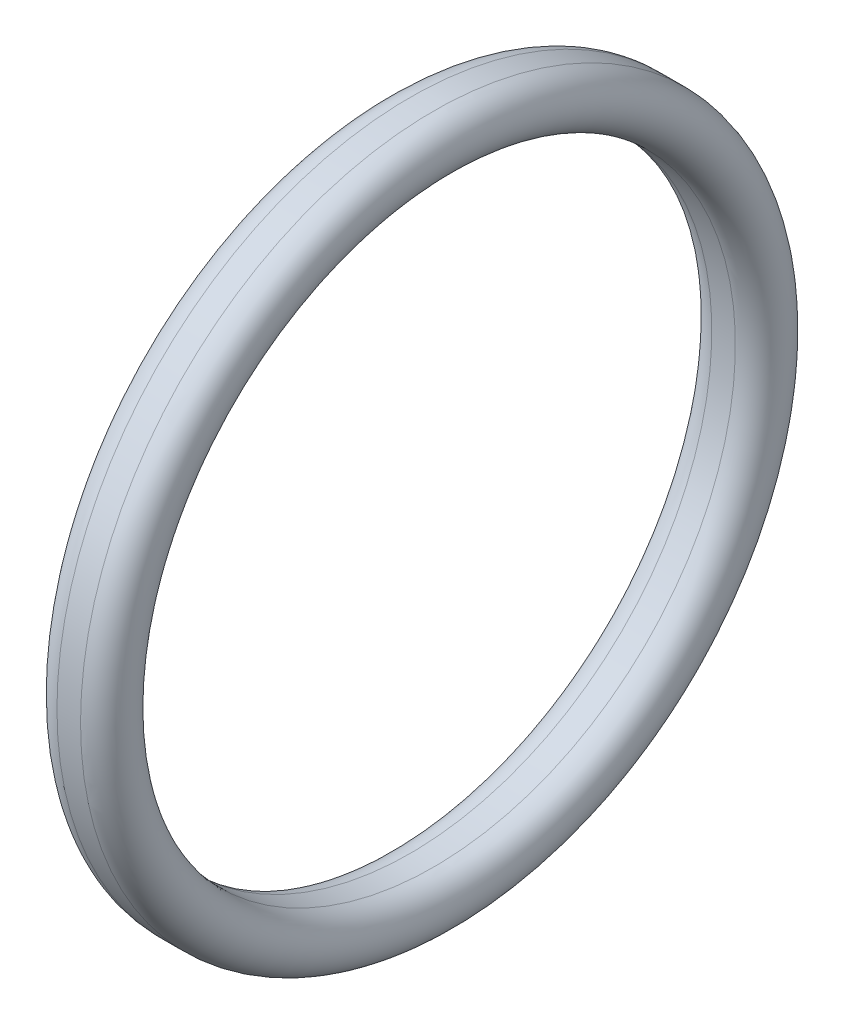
from build123d import *


with BuildPart() as part:
    # Sketch1 → Revolve1 (revolve)
    with BuildSketch(Plane.XY, mode=Mode.PRIVATE) as revolve1_sk:
        with BuildLine():
            Line((-0.635, 19.0246), (0.635, 19.0246))
            ThreePointArc((0.635, 19.0246), (2.02565, 17.63395), (0.635, 16.2433))
            Line((0.635, 16.2433), (-0.635, 16.2433))
            ThreePointArc((-0.635, 16.2433), (-2.02565, 17.63395), (-0.635, 19.0246))
        make_face()
    revolve(revolve1_sk.sketch.rotate(Axis((0, 0, 0), (1, 0, 0)), 90), axis=Axis((0, 0, 0), (1, 0, 0)))


solid = part.part
